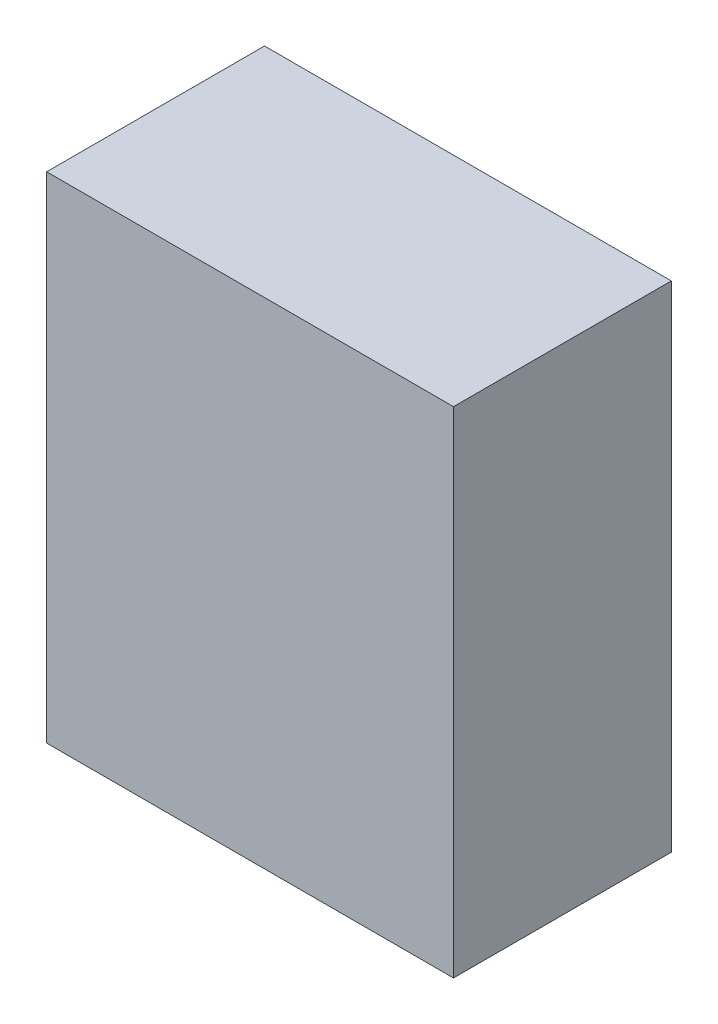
ISO-10303-21;
HEADER;
FILE_DESCRIPTION(('STEP AP214'),'2;1');
FILE_NAME('part.step','',(''),(''),'','','');
FILE_SCHEMA(('AUTOMOTIVE_DESIGN { 1 0 10303 214 1 1 1 1 }'));
ENDSEC;
DATA;
#1=APPLICATION_CONTEXT('core data for automotive mechanical design processes');
#2=APPLICATION_PROTOCOL_DEFINITION('international standard','automotive_design',2000,#1);
#3=PRODUCT_CONTEXT('',#1,'mechanical');
#4=PRODUCT('Part','Part','',(#3));
#5=PRODUCT_RELATED_PRODUCT_CATEGORY('part','',(#4));
#6=PRODUCT_DEFINITION_FORMATION('','',#4);
#7=PRODUCT_DEFINITION_CONTEXT('part definition',#1,'design');
#8=PRODUCT_DEFINITION('design','',#6,#7);
#9=PRODUCT_DEFINITION_SHAPE('','',#8);
#10=(LENGTH_UNIT() NAMED_UNIT(*) SI_UNIT(.MILLI.,.METRE.));
#11=(NAMED_UNIT(*) PLANE_ANGLE_UNIT() SI_UNIT($,.RADIAN.));
#12=(NAMED_UNIT(*) SI_UNIT($,.STERADIAN.) SOLID_ANGLE_UNIT());
#13=UNCERTAINTY_MEASURE_WITH_UNIT(LENGTH_MEASURE(1.E-05),#10,'distance_accuracy_value','');
#14=(GEOMETRIC_REPRESENTATION_CONTEXT(3) GLOBAL_UNCERTAINTY_ASSIGNED_CONTEXT((#13)) GLOBAL_UNIT_ASSIGNED_CONTEXT((#10,
#11,#12)) REPRESENTATION_CONTEXT('',''));
#15=CARTESIAN_POINT('',(0.,0.,0.));
#16=DIRECTION('',(0.,0.,1.));
#17=DIRECTION('',(1.,0.,0.));
#18=AXIS2_PLACEMENT_3D('',#15,#16,#17);
#19=CARTESIAN_POINT('',(0.92499942,1.12499902,0.9906));
#20=DIRECTION('',(0.,0.,1.));
#21=DIRECTION('',(1.,0.,0.));
#22=AXIS2_PLACEMENT_3D('',#19,#20,#21);
#23=PLANE('',#22);
#24=DIRECTION('',(1.,0.,0.));
#25=VECTOR('',#24,1.);
#26=CARTESIAN_POINT('',(0.92499942,-1.12499902,0.9906));
#27=LINE('',#26,#25);
#28=CARTESIAN_POINT('',(0.92499942,-1.12499902,0.9906));
#29=VERTEX_POINT('',#28);
#30=CARTESIAN_POINT('',(-0.92499942,-1.12499902,0.9906));
#31=VERTEX_POINT('',#30);
#32=EDGE_CURVE('E53',#29,#31,#27,.F.);
#33=ORIENTED_EDGE('',*,*,#32,.F.);
#34=DIRECTION('',(0.,1.,0.));
#35=VECTOR('',#34,1.);
#36=CARTESIAN_POINT('',(0.92499942,1.12499902,0.9906));
#37=LINE('',#36,#35);
#38=CARTESIAN_POINT('',(0.92499942,1.12499902,0.9906));
#39=VERTEX_POINT('',#38);
#40=EDGE_CURVE('E68',#39,#29,#37,.F.);
#41=ORIENTED_EDGE('',*,*,#40,.F.);
#42=DIRECTION('',(1.,0.,0.));
#43=VECTOR('',#42,1.);
#44=CARTESIAN_POINT('',(-0.92499942,1.12499902,0.9906));
#45=LINE('',#44,#43);
#46=CARTESIAN_POINT('',(-0.92499942,1.12499902,0.9906));
#47=VERTEX_POINT('',#46);
#48=EDGE_CURVE('E20',#47,#39,#45,.T.);
#49=ORIENTED_EDGE('',*,*,#48,.F.);
#50=DIRECTION('',(0.,1.,0.));
#51=VECTOR('',#50,1.);
#52=CARTESIAN_POINT('',(-0.92499942,-1.12499902,0.9906));
#53=LINE('',#52,#51);
#54=EDGE_CURVE('E58',#31,#47,#53,.T.);
#55=ORIENTED_EDGE('',*,*,#54,.F.);
#56=EDGE_LOOP('',(#33,#41,#49,#55));
#57=FACE_BOUND('',#56,.T.);
#58=ADVANCED_FACE('F17',(#57),#23,.T.);
#59=CARTESIAN_POINT('',(-0.92499942,1.12499902,0.));
#60=DIRECTION('',(0.,1.,0.));
#61=DIRECTION('',(0.,0.,1.));
#62=AXIS2_PLACEMENT_3D('',#59,#60,#61);
#63=PLANE('',#62);
#64=DIRECTION('',(0.,0.,-1.));
#65=VECTOR('',#64,1.);
#66=CARTESIAN_POINT('',(0.92499942,1.12499902,0.));
#67=LINE('',#66,#65);
#68=CARTESIAN_POINT('',(0.92499942,1.12499902,0.));
#69=VERTEX_POINT('',#68);
#70=EDGE_CURVE('E79',#69,#39,#67,.F.);
#71=ORIENTED_EDGE('',*,*,#70,.F.);
#72=DIRECTION('',(1.,0.,0.));
#73=VECTOR('',#72,1.);
#74=CARTESIAN_POINT('',(0.92499942,1.12499902,0.));
#75=LINE('',#74,#73);
#76=CARTESIAN_POINT('',(-0.92499942,1.12499902,0.));
#77=VERTEX_POINT('',#76);
#78=EDGE_CURVE('E74',#69,#77,#75,.F.);
#79=ORIENTED_EDGE('',*,*,#78,.T.);
#80=DIRECTION('',(0.,0.,1.));
#81=VECTOR('',#80,1.);
#82=CARTESIAN_POINT('',(-0.92499942,1.12499902,0.));
#83=LINE('',#82,#81);
#84=EDGE_CURVE('E63',#47,#77,#83,.F.);
#85=ORIENTED_EDGE('',*,*,#84,.F.);
#86=ORIENTED_EDGE('',*,*,#48,.T.);
#87=EDGE_LOOP('',(#71,#79,#85,#86));
#88=FACE_BOUND('',#87,.T.);
#89=ADVANCED_FACE('F73',(#88),#63,.T.);
#90=CARTESIAN_POINT('',(-0.92499942,-1.12499902,0.));
#91=DIRECTION('',(-1.,0.,0.));
#92=DIRECTION('',(0.,0.,1.));
#93=AXIS2_PLACEMENT_3D('',#90,#91,#92);
#94=PLANE('',#93);
#95=ORIENTED_EDGE('',*,*,#84,.T.);
#96=DIRECTION('',(0.,1.,0.));
#97=VECTOR('',#96,1.);
#98=CARTESIAN_POINT('',(-0.92499942,1.12499902,0.));
#99=LINE('',#98,#97);
#100=CARTESIAN_POINT('',(-0.92499942,-1.12499902,0.));
#101=VERTEX_POINT('',#100);
#102=EDGE_CURVE('E84',#77,#101,#99,.F.);
#103=ORIENTED_EDGE('',*,*,#102,.T.);
#104=DIRECTION('',(0.,0.,-1.));
#105=VECTOR('',#104,1.);
#106=CARTESIAN_POINT('',(-0.92499942,-1.12499902,0.));
#107=LINE('',#106,#105);
#108=EDGE_CURVE('E65',#31,#101,#107,.T.);
#109=ORIENTED_EDGE('',*,*,#108,.F.);
#110=ORIENTED_EDGE('',*,*,#54,.T.);
#111=EDGE_LOOP('',(#95,#103,#109,#110));
#112=FACE_BOUND('',#111,.T.);
#113=ADVANCED_FACE('F60',(#112),#94,.T.);
#114=CARTESIAN_POINT('',(0.92499942,-1.12499902,0.));
#115=DIRECTION('',(0.,-1.,0.));
#116=DIRECTION('',(0.,0.,-1.));
#117=AXIS2_PLACEMENT_3D('',#114,#115,#116);
#118=PLANE('',#117);
#119=ORIENTED_EDGE('',*,*,#108,.T.);
#120=DIRECTION('',(1.,0.,0.));
#121=VECTOR('',#120,1.);
#122=CARTESIAN_POINT('',(0.92499942,-1.12499902,0.));
#123=LINE('',#122,#121);
#124=CARTESIAN_POINT('',(0.92499942,-1.12499902,0.));
#125=VERTEX_POINT('',#124);
#126=EDGE_CURVE('E26',#101,#125,#123,.T.);
#127=ORIENTED_EDGE('',*,*,#126,.T.);
#128=DIRECTION('',(0.,0.,-1.));
#129=VECTOR('',#128,1.);
#130=CARTESIAN_POINT('',(0.92499942,-1.12499902,0.));
#131=LINE('',#130,#129);
#132=EDGE_CURVE('E34',#29,#125,#131,.T.);
#133=ORIENTED_EDGE('',*,*,#132,.F.);
#134=ORIENTED_EDGE('',*,*,#32,.T.);
#135=EDGE_LOOP('',(#119,#127,#133,#134));
#136=FACE_BOUND('',#135,.T.);
#137=ADVANCED_FACE('F88',(#136),#118,.T.);
#138=CARTESIAN_POINT('',(0.92499942,1.12499902,0.));
#139=DIRECTION('',(1.,0.,0.));
#140=DIRECTION('',(0.,0.,-1.));
#141=AXIS2_PLACEMENT_3D('',#138,#139,#140);
#142=PLANE('',#141);
#143=ORIENTED_EDGE('',*,*,#132,.T.);
#144=DIRECTION('',(0.,1.,0.));
#145=VECTOR('',#144,1.);
#146=CARTESIAN_POINT('',(0.92499942,1.12499902,0.));
#147=LINE('',#146,#145);
#148=EDGE_CURVE('E11',#125,#69,#147,.T.);
#149=ORIENTED_EDGE('',*,*,#148,.T.);
#150=ORIENTED_EDGE('',*,*,#70,.T.);
#151=ORIENTED_EDGE('',*,*,#40,.T.);
#152=EDGE_LOOP('',(#143,#149,#150,#151));
#153=FACE_BOUND('',#152,.T.);
#154=ADVANCED_FACE('F91',(#153),#142,.T.);
#155=CARTESIAN_POINT('',(0.92499942,1.12499902,0.));
#156=DIRECTION('',(0.,0.,1.));
#157=DIRECTION('',(1.,0.,0.));
#158=AXIS2_PLACEMENT_3D('',#155,#156,#157);
#159=PLANE('',#158);
#160=ORIENTED_EDGE('',*,*,#126,.F.);
#161=ORIENTED_EDGE('',*,*,#102,.F.);
#162=ORIENTED_EDGE('',*,*,#78,.F.);
#163=ORIENTED_EDGE('',*,*,#148,.F.);
#164=EDGE_LOOP('',(#160,#161,#162,#163));
#165=FACE_BOUND('',#164,.T.);
#166=ADVANCED_FACE('F90',(#165),#159,.F.);
#167=CLOSED_SHELL('',(#58,#89,#113,#137,#154,#166));
#168=MANIFOLD_SOLID_BREP('B1',#167);
#169=ADVANCED_BREP_SHAPE_REPRESENTATION('',(#18,#168),#14);
#170=SHAPE_DEFINITION_REPRESENTATION(#9,#169);
ENDSEC;
END-ISO-10303-21;
